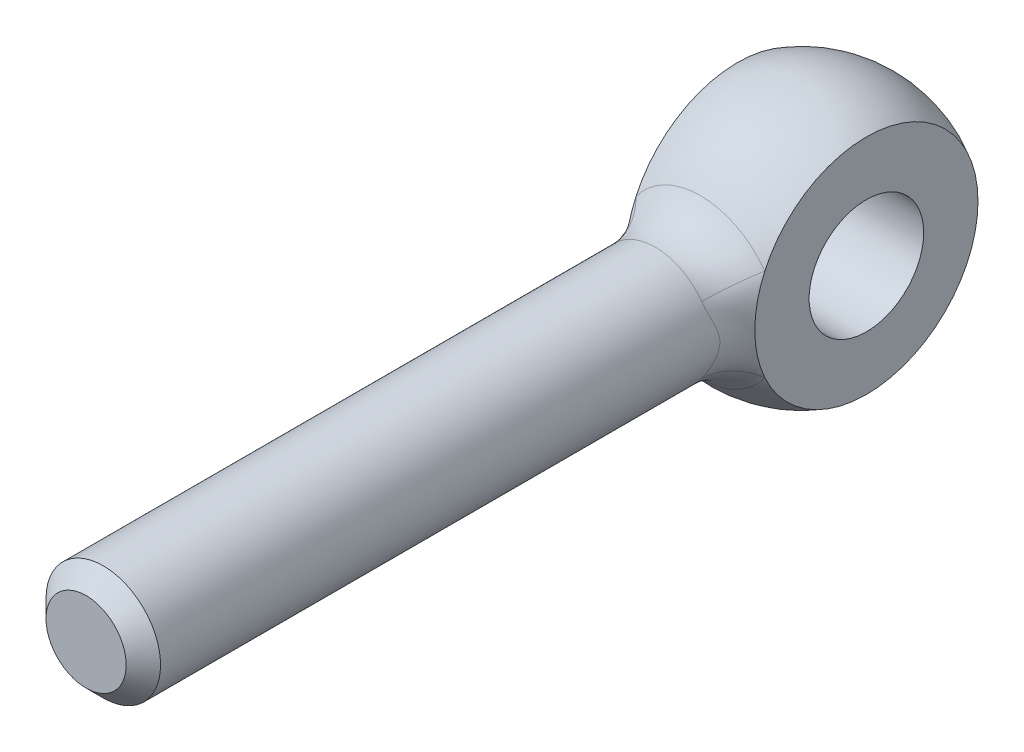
ISO-10303-21;
HEADER;
FILE_DESCRIPTION(('STEP AP214'),'2;1');
FILE_NAME('part.step','',(''),(''),'','','');
FILE_SCHEMA(('AUTOMOTIVE_DESIGN { 1 0 10303 214 1 1 1 1 }'));
ENDSEC;
DATA;
#1=APPLICATION_CONTEXT('core data for automotive mechanical design processes');
#2=APPLICATION_PROTOCOL_DEFINITION('international standard','automotive_design',2000,#1);
#3=PRODUCT_CONTEXT('',#1,'mechanical');
#4=PRODUCT('Part','Part','',(#3));
#5=PRODUCT_RELATED_PRODUCT_CATEGORY('part','',(#4));
#6=PRODUCT_DEFINITION_FORMATION('','',#4);
#7=PRODUCT_DEFINITION_CONTEXT('part definition',#1,'design');
#8=PRODUCT_DEFINITION('design','',#6,#7);
#9=PRODUCT_DEFINITION_SHAPE('','',#8);
#10=(LENGTH_UNIT() NAMED_UNIT(*) SI_UNIT(.MILLI.,.METRE.));
#11=(NAMED_UNIT(*) PLANE_ANGLE_UNIT() SI_UNIT($,.RADIAN.));
#12=(NAMED_UNIT(*) SI_UNIT($,.STERADIAN.) SOLID_ANGLE_UNIT());
#13=UNCERTAINTY_MEASURE_WITH_UNIT(LENGTH_MEASURE(1.E-05),#10,'distance_accuracy_value','');
#14=(GEOMETRIC_REPRESENTATION_CONTEXT(3) GLOBAL_UNCERTAINTY_ASSIGNED_CONTEXT((#13)) GLOBAL_UNIT_ASSIGNED_CONTEXT((#10,
#11,#12)) REPRESENTATION_CONTEXT('',''));
#15=CARTESIAN_POINT('',(0.,0.,0.));
#16=DIRECTION('',(0.,0.,1.));
#17=DIRECTION('',(1.,0.,0.));
#18=AXIS2_PLACEMENT_3D('',#15,#16,#17);
#19=CARTESIAN_POINT('',(0.,0.,0.));
#20=DIRECTION('',(1.,0.,0.));
#21=DIRECTION('',(0.,0.,-1.));
#22=AXIS2_PLACEMENT_3D('',#19,#20,#21);
#23=SPHERICAL_SURFACE('',#22,9.);
#24=CARTESIAN_POINT('',(-4.5,0.,0.));
#25=DIRECTION('',(-1.,0.,0.));
#26=DIRECTION('',(0.,0.,1.));
#27=AXIS2_PLACEMENT_3D('',#24,#25,#26);
#28=CIRCLE('',#27,7.79422863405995);
#29=CARTESIAN_POINT('',(-4.5,-3.22870813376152,7.09404283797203));
#30=VERTEX_POINT('',#29);
#31=CARTESIAN_POINT('',(-4.5,3.22870813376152,7.09404283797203));
#32=VERTEX_POINT('',#31);
#33=EDGE_CURVE('E65',#30,#32,#28,.F.);
#34=ORIENTED_EDGE('',*,*,#33,.T.);
#35=CARTESIAN_POINT('',(0.,0.,7.09404283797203));
#36=DIRECTION('',(0.,0.,-1.));
#37=DIRECTION('',(-1.,0.,0.));
#38=AXIS2_PLACEMENT_3D('',#35,#36,#37);
#39=CIRCLE('',#38,5.53846153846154);
#40=CARTESIAN_POINT('',(4.5,3.22870813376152,7.09404283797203));
#41=VERTEX_POINT('',#40);
#42=EDGE_CURVE('E73',#32,#41,#39,.T.);
#43=ORIENTED_EDGE('',*,*,#42,.T.);
#44=CARTESIAN_POINT('',(4.5,0.,0.));
#45=DIRECTION('',(-1.,0.,0.));
#46=DIRECTION('',(0.,0.,1.));
#47=AXIS2_PLACEMENT_3D('',#44,#45,#46);
#48=CIRCLE('',#47,7.79422863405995);
#49=CARTESIAN_POINT('',(4.5,-3.22870813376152,7.09404283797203));
#50=VERTEX_POINT('',#49);
#51=EDGE_CURVE('E61',#50,#41,#48,.F.);
#52=ORIENTED_EDGE('',*,*,#51,.F.);
#53=CARTESIAN_POINT('',(0.,0.,7.09404283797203));
#54=DIRECTION('',(0.,0.,-1.));
#55=DIRECTION('',(-1.,0.,0.));
#56=AXIS2_PLACEMENT_3D('',#53,#54,#55);
#57=CIRCLE('',#56,5.53846153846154);
#58=EDGE_CURVE('E70',#50,#30,#57,.T.);
#59=ORIENTED_EDGE('',*,*,#58,.T.);
#60=EDGE_LOOP('',(#34,#43,#52,#59));
#61=FACE_BOUND('',#60,.T.);
#62=ADVANCED_FACE('F14',(#61),#23,.T.);
#63=CARTESIAN_POINT('',(0.,0.,-10.));
#64=DIRECTION('',(0.,0.,-1.));
#65=DIRECTION('',(-1.,0.,0.));
#66=AXIS2_PLACEMENT_3D('',#63,#64,#65);
#67=CYLINDRICAL_SURFACE('',#66,4.);
#68=CARTESIAN_POINT('',(-4.5,-3.85444578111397,6.77445552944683));
#69=CARTESIAN_POINT('',(-3.04270473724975,-2.62315351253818,7.93032270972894));
#70=CARTESIAN_POINT('',(-2.7741231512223,-2.881707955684,10.1296027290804));
#71=CARTESIAN_POINT('',(-4.5,-3.80635520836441,6.80181404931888));
#72=CARTESIAN_POINT('',(-3.05482576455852,-2.6036944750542,7.96461619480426));
#73=CARTESIAN_POINT('',(-2.81753121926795,-2.83992613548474,10.1500330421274));
#74=CARTESIAN_POINT('',(-4.5,-3.75734620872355,6.8290243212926));
#75=CARTESIAN_POINT('',(-3.06839168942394,-2.58331636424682,7.99813663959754));
#76=CARTESIAN_POINT('',(-2.86015231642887,-2.79700081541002,10.1676065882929));
#77=CARTESIAN_POINT('',(-4.5,-3.65731222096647,6.88311775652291));
#78=CARTESIAN_POINT('',(-3.09821295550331,-2.54027572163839,8.06327876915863));
#79=CARTESIAN_POINT('',(-2.94360667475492,-2.70903056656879,10.197319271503));
#80=CARTESIAN_POINT('',(-4.5,-3.60628811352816,6.9100010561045));
#81=CARTESIAN_POINT('',(-3.11445034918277,-2.51763114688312,8.09489992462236));
#82=CARTESIAN_POINT('',(-2.98444070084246,-2.66398656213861,10.2094607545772));
#83=CARTESIAN_POINT('',(-4.5,-3.45034294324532,6.98990310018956));
#84=CARTESIAN_POINT('',(-3.16665597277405,-2.44590984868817,8.1861654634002));
#85=CARTESIAN_POINT('',(-3.10362883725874,-2.52629694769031,10.2380896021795));
#86=CARTESIAN_POINT('',(-4.5,-3.34210856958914,7.04242695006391));
#87=CARTESIAN_POINT('',(-3.20638316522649,-2.39264902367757,8.2429806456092));
#88=CARTESIAN_POINT('',(-3.17907335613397,-2.43070509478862,10.2469645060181));
#89=CARTESIAN_POINT('',(-4.5,-3.07131788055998,7.1656813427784));
#90=CARTESIAN_POINT('',(-3.30980222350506,-2.24847718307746,8.36667989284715));
#91=CARTESIAN_POINT('',(-3.3484402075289,-2.19463495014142,10.2469316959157));
#92=CARTESIAN_POINT('',(-4.5,-2.90397618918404,7.23557083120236));
#93=CARTESIAN_POINT('',(-3.37687085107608,-2.15099293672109,8.42942404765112));
#94=CARTESIAN_POINT('',(-3.4381775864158,-2.05112903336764,10.2297903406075));
#95=CARTESIAN_POINT('',(-4.5,-2.6352089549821,7.33585873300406));
#96=CARTESIAN_POINT('',(-3.48042901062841,-1.97974794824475,8.50775356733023));
#97=CARTESIAN_POINT('',(-3.55838650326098,-1.82895031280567,10.1852430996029));
#98=CARTESIAN_POINT('',(-4.5,-2.54243406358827,7.36859815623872));
#99=CARTESIAN_POINT('',(-3.51533532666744,-1.91871301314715,8.53118988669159));
#100=CARTESIAN_POINT('',(-3.5961245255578,-1.75356165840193,10.1671934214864));
#101=CARTESIAN_POINT('',(-4.5,-2.35049327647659,7.4320525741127));
#102=CARTESIAN_POINT('',(-3.58449538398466,-1.7884352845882,8.57274310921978));
#103=CARTESIAN_POINT('',(-3.66666176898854,-1.60082878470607,10.1262456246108));
#104=CARTESIAN_POINT('',(-4.5,-2.25132856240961,7.46276794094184));
#105=CARTESIAN_POINT('',(-3.61876374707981,-1.71923098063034,8.59090327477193));
#106=CARTESIAN_POINT('',(-3.69946189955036,-1.52348492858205,10.1033484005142));
#107=CARTESIAN_POINT('',(-4.5,-2.03046131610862,7.52611271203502));
#108=CARTESIAN_POINT('',(-3.69027444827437,-1.56151844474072,8.6245207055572));
#109=CARTESIAN_POINT('',(-3.76469519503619,-1.35514764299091,10.0506349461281));
#110=CARTESIAN_POINT('',(-4.5,-1.90763213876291,7.5583156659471));
#111=CARTESIAN_POINT('',(-3.72725176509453,-1.47161056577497,8.63921494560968));
#112=CARTESIAN_POINT('',(-3.79630400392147,-1.26387674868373,10.020296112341));
#113=CARTESIAN_POINT('',(-4.5,-1.6523218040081,7.61820329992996));
#114=CARTESIAN_POINT('',(-3.79632113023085,-1.28138713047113,8.66269061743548));
#115=CARTESIAN_POINT('',(-3.85283376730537,-1.07934568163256,9.95859137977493));
#116=CARTESIAN_POINT('',(-4.5,-1.51983775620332,7.64588661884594));
#117=CARTESIAN_POINT('',(-3.82847639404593,-1.18104454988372,8.67151974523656));
#118=CARTESIAN_POINT('',(-3.87775270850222,-0.986084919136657,9.92722517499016));
#119=CARTESIAN_POINT('',(-4.5,-1.24584793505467,7.69526663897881));
#120=CARTESIAN_POINT('',(-3.8857422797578,-0.971416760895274,8.68456342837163));
#121=CARTESIAN_POINT('',(-3.92072690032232,-0.798212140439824,9.86763071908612));
#122=CARTESIAN_POINT('',(-4.5,-1.10438777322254,7.71699102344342));
#123=CARTESIAN_POINT('',(-3.91095703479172,-0.862096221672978,8.6888316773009));
#124=CARTESIAN_POINT('',(-3.93881404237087,-0.703608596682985,9.83938833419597));
#125=CARTESIAN_POINT('',(-4.5,-0.81298603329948,7.75309875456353));
#126=CARTESIAN_POINT('',(-3.95269307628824,-0.635873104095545,8.69452000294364));
#127=CARTESIAN_POINT('',(-3.96815692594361,-0.512865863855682,9.79055451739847));
#128=CARTESIAN_POINT('',(-4.5,-0.663048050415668,7.7674851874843));
#129=CARTESIAN_POINT('',(-3.9692841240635,-0.518825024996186,8.69595666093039));
#130=CARTESIAN_POINT('',(-3.97941553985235,-0.416727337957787,9.76995986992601));
#131=CARTESIAN_POINT('',(-4.5,-0.365918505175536,7.78697722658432));
#132=CARTESIAN_POINT('',(-3.99168629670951,-0.286607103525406,8.69758027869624));
#133=CARTESIAN_POINT('',(-3.99451236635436,-0.228642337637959,9.74161988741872));
#134=CARTESIAN_POINT('',(-4.5,-0.219018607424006,7.79254362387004));
#135=CARTESIAN_POINT('',(-3.99806921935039,-0.171508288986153,8.69783425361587));
#136=CARTESIAN_POINT('',(-3.99871971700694,-0.136751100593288,9.73323857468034));
#137=CARTESIAN_POINT('',(-4.5,0.0755179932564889,7.79525312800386));
#138=CARTESIAN_POINT('',(-4.0011736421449,0.0591123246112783,8.69798034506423));
#139=CARTESIAN_POINT('',(-4.00077867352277,0.0471659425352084,9.72918999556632));
#140=CARTESIAN_POINT('',(-4.5,0.223154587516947,7.79239744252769));
#141=CARTESIAN_POINT('',(-3.99790203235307,0.174838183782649,8.6978727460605));
#142=CARTESIAN_POINT('',(-3.99863119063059,0.139191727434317,9.73352090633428));
#143=CARTESIAN_POINT('',(-4.5,0.5153988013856,7.77855435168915));
#144=CARTESIAN_POINT('',(-3.98201549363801,0.403449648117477,8.69691703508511));
#145=CARTESIAN_POINT('',(-3.98800822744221,0.32296739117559,9.75391826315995));
#146=CARTESIAN_POINT('',(-4.5,0.65998856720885,7.76752813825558));
#147=CARTESIAN_POINT('',(-3.96932852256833,0.516511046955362,8.69606347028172));
#148=CARTESIAN_POINT('',(-3.97950254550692,0.414713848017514,9.77004071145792));
#149=CARTESIAN_POINT('',(-4.5,0.94228575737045,7.73836483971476));
#150=CARTESIAN_POINT('',(-3.93569076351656,0.736344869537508,8.6923726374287));
#151=CARTESIAN_POINT('',(-3.95627218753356,0.596957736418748,9.81071532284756));
#152=CARTESIAN_POINT('',(-4.5,1.07998946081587,7.72022395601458));
#153=CARTESIAN_POINT('',(-3.91468418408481,0.843262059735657,8.6895253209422));
#154=CARTESIAN_POINT('',(-3.94154418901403,0.687454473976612,9.83527198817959));
#155=CARTESIAN_POINT('',(-4.5,1.37588488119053,7.67359135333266));
#156=CARTESIAN_POINT('',(-3.86060975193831,1.07137605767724,8.67936366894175));
#157=CARTESIAN_POINT('',(-3.90215083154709,0.886344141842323,9.8945073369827));
#158=CARTESIAN_POINT('',(-4.5,1.53205621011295,7.64370888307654));
#159=CARTESIAN_POINT('',(-3.82584552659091,1.19066873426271,8.67118584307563));
#160=CARTESIAN_POINT('',(-3.87602422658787,0.994368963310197,9.93022639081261));
#161=CARTESIAN_POINT('',(-4.5,1.83152716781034,7.57753636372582));
#162=CARTESIAN_POINT('',(-3.74933129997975,1.41560294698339,8.64748821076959));
#163=CARTESIAN_POINT('',(-3.81488436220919,1.20788558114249,10.0015265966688));
#164=CARTESIAN_POINT('',(-4.5,1.97482610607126,7.54124597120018));
#165=CARTESIAN_POINT('',(-3.70747741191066,1.5213009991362,8.63189853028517));
#166=CARTESIAN_POINT('',(-3.77987062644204,1.31337724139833,10.0371077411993));
#167=CARTESIAN_POINT('',(-4.5,2.24871161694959,7.46414404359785));
#168=CARTESIAN_POINT('',(-3.62012648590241,1.7179734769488,8.59208691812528));
#169=CARTESIAN_POINT('',(-3.70118920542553,1.5210087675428,10.1029124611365));
#170=CARTESIAN_POINT('',(-4.5,2.37934961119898,7.42335237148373));
#171=CARTESIAN_POINT('',(-3.574572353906,1.80898132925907,8.56781003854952));
#172=CARTESIAN_POINT('',(-3.65755891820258,1.62316096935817,10.1331581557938));
#173=CARTESIAN_POINT('',(-4.5,2.62960061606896,7.33843673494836));
#174=CARTESIAN_POINT('',(-3.48292493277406,1.97675657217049,8.51005890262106));
#175=CARTESIAN_POINT('',(-3.5616888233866,1.82393375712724,10.1845863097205));
#176=CARTESIAN_POINT('',(-4.5,2.7492173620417,7.29431390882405));
#177=CARTESIAN_POINT('',(-3.43680579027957,2.05343576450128,8.47648952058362));
#178=CARTESIAN_POINT('',(-3.50945194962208,1.92255553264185,10.2057718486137));
#179=CARTESIAN_POINT('',(-4.5,2.94999939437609,7.2149891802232));
#180=CARTESIAN_POINT('',(-3.35849710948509,2.17571119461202,8.4098829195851));
#181=CARTESIAN_POINT('',(-3.41071958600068,2.09141957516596,10.2322288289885));
#182=CARTESIAN_POINT('',(-4.5,3.03332698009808,7.18029900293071));
#183=CARTESIAN_POINT('',(-3.32563979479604,2.22433900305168,8.37868925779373));
#184=CARTESIAN_POINT('',(-3.36602915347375,2.16261785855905,10.2401482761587));
#185=CARTESIAN_POINT('',(-4.5,3.19484965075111,7.1099009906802));
#186=CARTESIAN_POINT('',(-3.26272074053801,2.31453556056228,8.3114926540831));
#187=CARTESIAN_POINT('',(-3.27220326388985,2.3021184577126,10.2480230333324));
#188=CARTESIAN_POINT('',(-4.5,3.27304643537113,7.07419349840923));
#189=CARTESIAN_POINT('',(-3.23268360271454,2.35604813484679,8.27546257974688));
#190=CARTESIAN_POINT('',(-3.22306929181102,2.37042172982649,10.2479809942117));
#191=CARTESIAN_POINT('',(-4.5,3.42565196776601,7.00158146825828));
#192=CARTESIAN_POINT('',(-3.17620411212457,2.43330706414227,8.19857609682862));
#193=CARTESIAN_POINT('',(-3.12008076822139,2.50445754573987,10.2388956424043));
#194=CARTESIAN_POINT('',(-4.5,3.50000806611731,6.96466797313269));
#195=CARTESIAN_POINT('',(-3.14984664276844,2.46892157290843,8.157655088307));
#196=CARTESIAN_POINT('',(-3.06617923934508,2.5701524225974,10.2297508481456));
#197=CARTESIAN_POINT('',(-4.5,3.64453597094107,6.8901322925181));
#198=CARTESIAN_POINT('',(-3.10187955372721,2.53501235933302,8.07177995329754));
#199=CARTESIAN_POINT('',(-2.95455075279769,2.69775137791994,10.2014354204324));
#200=CARTESIAN_POINT('',(-4.5,3.71470335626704,6.85250941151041));
#201=CARTESIAN_POINT('',(-3.08031937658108,2.56543141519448,8.02681699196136));
#202=CARTESIAN_POINT('',(-2.89681988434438,2.75965145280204,10.1822543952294));
#203=CARTESIAN_POINT('',(-4.5,3.78298226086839,6.81461996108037));
#204=CARTESIAN_POINT('',(-3.06161168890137,2.59377871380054,7.9802897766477));
#205=CARTESIAN_POINT('',(-2.83743688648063,2.81938857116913,10.1576271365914));
#206=(BOUNDED_SURFACE() B_SPLINE_SURFACE(3,2,((#68,#69,#70),(#71,#72,#73),(#74,#75,#76),(#77,
#78,#79),(#80,#81,#82),(#83,#84,#85),(#86,#87,#88),(#89,#90,#91),(#92,#93,#94),(#95,#96,#97),
(#98,#99,#100),(#101,#102,#103),(#104,#105,#106),(#107,#108,#109),(#110,#111,#112),(#113,#114,
#115),(#116,#117,#118),(#119,#120,#121),(#122,#123,#124),(#125,#126,#127),(#128,#129,#130),
(#131,#132,#133),(#134,#135,#136),(#137,#138,#139),(#140,#141,#142),(#143,#144,#145),(#146,#147,
#148),(#149,#150,#151),(#152,#153,#154),(#155,#156,#157),(#158,#159,#160),(#161,#162,#163),
(#164,#165,#166),(#167,#168,#169),(#170,#171,#172),(#173,#174,#175),(#176,#177,#178),(#179,#180,
#181),(#182,#183,#184),(#185,#186,#187),(#188,#189,#190),(#191,#192,#193),(#194,#195,#196),
(#197,#198,#199),(#200,#201,#202),(#203,#204,#205)),.UNSPECIFIED.,.F.,.F.,
.F.) B_SPLINE_SURFACE_WITH_KNOTS((4,2,2,2,2,2,2,2,2,2,2,2,2,2,2,2,2,2,2,2,2,2,4),(3,3),(0.,
0.366533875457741,0.732909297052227,1.46227559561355,2.47457458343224,2.98299508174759,
3.49132182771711,4.07744171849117,4.66373780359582,5.24726215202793,5.8305408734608,
6.38220343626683,6.93378689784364,7.4880071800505,8.04252376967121,8.71711530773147,
9.39174301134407,10.0635045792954,10.7350376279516,11.2394940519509,11.7437825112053,
12.2537566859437,12.7642599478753),(0.,1.),
.UNSPECIFIED.) GEOMETRIC_REPRESENTATION_ITEM() RATIONAL_B_SPLINE_SURFACE(((1.,0.873374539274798,
1.),(1.,0.875240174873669,1.),(1.,0.877181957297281,1.),(1.,0.881198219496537,1.),(1.,
0.883272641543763,1.),(1.,0.889648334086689,1.),(1.,0.894119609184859,1.),(1.,0.905097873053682,
1.),(1.,0.911721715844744,1.),(1.,0.921524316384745,1.),(1.,0.924776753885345,1.),(1.,
0.931143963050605,1.),(1.,0.934258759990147,1.),(1.,0.940716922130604,1.),(1.,0.944022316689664,
1.),(1.,0.950179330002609,1.),(1.,0.953030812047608,1.),(1.,0.958111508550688,1.),(1.,
0.960343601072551,1.),(1.,0.964046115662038,1.),(1.,0.965516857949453,1.),(1.,0.967507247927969,
1.),(1.,0.968074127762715,1.),(1.,0.96835024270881,1.),(1.,0.968059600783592,1.),(1.,
0.966647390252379,1.),(1.,0.965521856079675,1.),(1.,0.962536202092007,1.),(1.,0.960675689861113,
1.),(1.,0.955882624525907,1.),(1.,0.952805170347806,1.),(1.,0.945996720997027,1.),(1.,
0.942265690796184,1.),(1.,0.934394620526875,1.),(1.,0.930256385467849,1.),(1.,0.921773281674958,
1.),(1.,0.91742848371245,1.),(1.,0.90981895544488,1.),(1.,0.906554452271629,1.),(1.,
0.90010633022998,1.),(1.,0.89692268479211,1.),(1.,0.890676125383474,1.),(1.,0.887614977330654,
1.),(1.,0.881712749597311,1.),(1.,0.878871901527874,1.),(1.,0.876174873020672,1.))) REPRESENTATION_ITEM('') SURFACE());
#207=CARTESIAN_POINT('',(-2.83743688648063,2.81938857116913,10.1576271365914));
#208=CARTESIAN_POINT('',(-2.89681988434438,2.75965145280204,10.1822543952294));
#209=CARTESIAN_POINT('',(-2.95455075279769,2.69775137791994,10.2014354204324));
#210=CARTESIAN_POINT('',(-3.06617923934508,2.5701524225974,10.2297508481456));
#211=CARTESIAN_POINT('',(-3.12008076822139,2.50445754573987,10.2388956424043));
#212=CARTESIAN_POINT('',(-3.22306929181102,2.37042172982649,10.2479809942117));
#213=CARTESIAN_POINT('',(-3.27220326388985,2.3021184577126,10.2480230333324));
#214=CARTESIAN_POINT('',(-3.36602915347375,2.16261785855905,10.2401482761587));
#215=CARTESIAN_POINT('',(-3.41071958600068,2.09141957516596,10.2322288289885));
#216=CARTESIAN_POINT('',(-3.50945194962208,1.92255553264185,10.2057718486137));
#217=CARTESIAN_POINT('',(-3.5616888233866,1.82393375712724,10.1845863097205));
#218=CARTESIAN_POINT('',(-3.65755891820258,1.62316096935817,10.1331581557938));
#219=CARTESIAN_POINT('',(-3.70118920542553,1.5210087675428,10.1029124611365));
#220=CARTESIAN_POINT('',(-3.77987062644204,1.31337724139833,10.0371077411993));
#221=CARTESIAN_POINT('',(-3.81488436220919,1.20788558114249,10.0015265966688));
#222=CARTESIAN_POINT('',(-3.87602422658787,0.994368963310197,9.93022639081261));
#223=CARTESIAN_POINT('',(-3.90215083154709,0.886344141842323,9.8945073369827));
#224=CARTESIAN_POINT('',(-3.94154418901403,0.687454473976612,9.83527198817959));
#225=CARTESIAN_POINT('',(-3.95627218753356,0.596957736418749,9.81071532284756));
#226=CARTESIAN_POINT('',(-3.97950254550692,0.414713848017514,9.77004071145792));
#227=CARTESIAN_POINT('',(-3.98800822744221,0.32296739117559,9.75391826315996));
#228=CARTESIAN_POINT('',(-3.99863119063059,0.139191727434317,9.73352090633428));
#229=CARTESIAN_POINT('',(-4.00077867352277,0.0471659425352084,9.72918999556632));
#230=CARTESIAN_POINT('',(-3.99871971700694,-0.136751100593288,9.73323857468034));
#231=CARTESIAN_POINT('',(-3.99451236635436,-0.228642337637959,9.74161988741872));
#232=CARTESIAN_POINT('',(-3.97941553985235,-0.416727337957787,9.76995986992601));
#233=CARTESIAN_POINT('',(-3.96815692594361,-0.512865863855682,9.79055451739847));
#234=CARTESIAN_POINT('',(-3.93881404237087,-0.703608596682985,9.83938833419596));
#235=CARTESIAN_POINT('',(-3.92072690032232,-0.798212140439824,9.86763071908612));
#236=CARTESIAN_POINT('',(-3.87775270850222,-0.986084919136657,9.92722517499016));
#237=CARTESIAN_POINT('',(-3.85283376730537,-1.07934568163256,9.95859137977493));
#238=CARTESIAN_POINT('',(-3.79630400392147,-1.26387674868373,10.020296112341));
#239=CARTESIAN_POINT('',(-3.76469519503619,-1.35514764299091,10.0506349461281));
#240=CARTESIAN_POINT('',(-3.69946189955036,-1.52348492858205,10.1033484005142));
#241=CARTESIAN_POINT('',(-3.66666176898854,-1.60082878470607,10.1262456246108));
#242=CARTESIAN_POINT('',(-3.5961245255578,-1.75356165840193,10.1671934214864));
#243=CARTESIAN_POINT('',(-3.55838650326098,-1.82895031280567,10.1852430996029));
#244=CARTESIAN_POINT('',(-3.4381775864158,-2.05112903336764,10.2297903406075));
#245=CARTESIAN_POINT('',(-3.34844020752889,-2.19463495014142,10.2469316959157));
#246=CARTESIAN_POINT('',(-3.17907335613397,-2.43070509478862,10.2469645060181));
#247=CARTESIAN_POINT('',(-3.10362883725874,-2.52629694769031,10.2380896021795));
#248=CARTESIAN_POINT('',(-2.98444070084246,-2.66398656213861,10.2094607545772));
#249=CARTESIAN_POINT('',(-2.94360667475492,-2.70903056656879,10.197319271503));
#250=CARTESIAN_POINT('',(-2.86015231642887,-2.79700081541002,10.1676065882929));
#251=CARTESIAN_POINT('',(-2.81753121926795,-2.83992613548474,10.1500330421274));
#252=CARTESIAN_POINT('',(-2.7741231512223,-2.881707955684,10.1296027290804));
#253=B_SPLINE_CURVE_WITH_KNOTS('',3,(#207,#208,#209,#210,#211,#212,#213,#214,#215,#216,#217,
#218,#219,#220,#221,#222,#223,#224,#225,#226,#227,#228,#229,#230,#231,#232,#233,#234,#235,#236,
#237,#238,#239,#240,#241,#242,#243,#244,#245,#246,#247,#248,#249,#250,#251,#252),.UNSPECIFIED.,
.F.,.F.,(4,2,2,2,2,2,2,2,2,2,2,2,2,2,2,2,2,2,2,2,2,2,4),(0.,0.510503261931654,1.02047743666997,
1.52476589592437,2.02922231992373,2.70075536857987,3.37251693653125,4.04714464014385,
4.72173617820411,5.27625276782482,5.83047305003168,6.38205651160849,6.93371907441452,
7.51699779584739,8.1005221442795,8.68681822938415,9.27293812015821,9.78126486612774,
10.2896853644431,11.3019843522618,12.0313506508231,12.3977260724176,12.7642599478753),.UNSPECIFIED.);
#254=CARTESIAN_POINT('',(-3.25,2.33184476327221,10.2469507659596));
#255=VERTEX_POINT('',#254);
#256=CARTESIAN_POINT('',(-3.25,-2.3318447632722,10.2469507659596));
#257=VERTEX_POINT('',#256);
#258=EDGE_CURVE('E88',#255,#257,#253,.T.);
#259=ORIENTED_EDGE('',*,*,#258,.T.);
#260=CARTESIAN_POINT('',(0.,0.,10.2469507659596));
#261=DIRECTION('',(0.,0.,-1.));
#262=DIRECTION('',(-1.,0.,0.));
#263=AXIS2_PLACEMENT_3D('',#260,#261,#262);
#264=CIRCLE('',#263,4.);
#265=CARTESIAN_POINT('',(3.25,-2.33184476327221,10.2469507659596));
#266=VERTEX_POINT('',#265);
#267=EDGE_CURVE('E9',#257,#266,#264,.F.);
#268=ORIENTED_EDGE('',*,*,#267,.T.);
#269=CARTESIAN_POINT('',(4.5,3.85444584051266,6.7744554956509));
#270=CARTESIAN_POINT('',(3.04270471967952,2.62315352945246,7.93032267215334));
#271=CARTESIAN_POINT('',(2.77412315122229,2.88170795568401,10.1296027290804));
#272=CARTESIAN_POINT('',(4.5,3.80635523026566,6.80181403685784));
#273=CARTESIAN_POINT('',(3.05482575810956,2.60369448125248,7.96461618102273));
#274=CARTESIAN_POINT('',(2.81753121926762,2.83992613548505,10.1500330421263));
#275=CARTESIAN_POINT('',(4.5,3.75734621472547,6.82902431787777));
#276=CARTESIAN_POINT('',(3.06839168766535,2.58331636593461,7.99813663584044));
#277=CARTESIAN_POINT('',(2.86015231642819,2.7970008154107,10.1676065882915));
#278=CARTESIAN_POINT('',(4.5,3.6573122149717,6.8831177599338));
#279=CARTESIAN_POINT('',(3.09821295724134,2.54027571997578,8.06327877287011));
#280=CARTESIAN_POINT('',(2.94360667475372,2.70903056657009,10.1973192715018));
#281=CARTESIAN_POINT('',(4.5,3.60628811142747,6.91000105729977));
#282=CARTESIAN_POINT('',(3.11445034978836,2.51763114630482,8.09489992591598));
#283=CARTESIAN_POINT('',(2.98444070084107,2.66398656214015,10.2094607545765));
#284=CARTESIAN_POINT('',(4.5,3.45034294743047,6.98990309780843));
#285=CARTESIAN_POINT('',(3.16665597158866,2.44590984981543,8.18616546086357));
#286=CARTESIAN_POINT('',(3.10362883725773,2.52629694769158,10.2380896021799));
#287=CARTESIAN_POINT('',(4.5,3.34210857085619,7.04242694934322));
#288=CARTESIAN_POINT('',(3.20638316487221,2.39264902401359,8.24298064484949));
#289=CARTESIAN_POINT('',(3.1790733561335,2.43070509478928,10.2469645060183));
#290=CARTESIAN_POINT('',(4.5,3.07131787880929,7.16568134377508));
#291=CARTESIAN_POINT('',(3.3098022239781,2.24847718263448,8.36667989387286));
#292=CARTESIAN_POINT('',(3.3484402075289,2.19463495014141,10.2469316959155));
#293=CARTESIAN_POINT('',(4.5,2.90397618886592,7.2355708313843));
#294=CARTESIAN_POINT('',(3.37687085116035,2.15099293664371,8.42942404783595));
#295=CARTESIAN_POINT('',(3.4381775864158,2.05112903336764,10.2297903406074));
#296=CARTESIAN_POINT('',(4.5,2.63520895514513,7.33585873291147));
#297=CARTESIAN_POINT('',(3.48042901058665,1.97974794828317,8.50775356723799));
#298=CARTESIAN_POINT('',(3.55838650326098,1.82895031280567,10.1852430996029));
#299=CARTESIAN_POINT('',(4.5,2.54243406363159,7.36859815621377));
#300=CARTESIAN_POINT('',(3.5153353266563,1.91871301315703,8.53118988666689));
#301=CARTESIAN_POINT('',(3.5961245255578,1.75356165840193,10.1671934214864));
#302=CARTESIAN_POINT('',(4.5,2.3504932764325,7.4320525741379));
#303=CARTESIAN_POINT('',(3.58449538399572,1.78843528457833,8.57274310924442));
#304=CARTESIAN_POINT('',(3.66666176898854,1.60082878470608,10.1262456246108));
#305=CARTESIAN_POINT('',(4.5,2.25132856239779,7.46276794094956));
#306=CARTESIAN_POINT('',(3.61876374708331,1.71923098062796,8.59090327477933));
#307=CARTESIAN_POINT('',(3.69946189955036,1.52348492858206,10.1033484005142));
#308=CARTESIAN_POINT('',(4.5,2.03046131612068,7.52611271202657));
#309=CARTESIAN_POINT('',(3.69027444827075,1.56151844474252,8.6245207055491));
#310=CARTESIAN_POINT('',(3.76469519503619,1.35514764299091,10.0506349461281));
#311=CARTESIAN_POINT('',(4.5,1.90763213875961,7.55831566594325));
#312=CARTESIAN_POINT('',(3.72725176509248,1.47161056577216,8.63921494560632));
#313=CARTESIAN_POINT('',(3.79630400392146,1.26387674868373,10.020296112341));
#314=CARTESIAN_POINT('',(4.5,1.6523218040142,7.61820329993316));
#315=CARTESIAN_POINT('',(3.79632113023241,1.28138713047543,8.66269061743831));
#316=CARTESIAN_POINT('',(3.85283376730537,1.07934568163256,9.95859137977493));
#317=CARTESIAN_POINT('',(4.5,1.51983775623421,7.64588661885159));
#318=CARTESIAN_POINT('',(3.82847639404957,1.18104454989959,8.6715197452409));
#319=CARTESIAN_POINT('',(3.87775270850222,0.986084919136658,9.92722517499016));
#320=CARTESIAN_POINT('',(4.5,1.24584793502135,7.69526663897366));
#321=CARTESIAN_POINT('',(3.88574227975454,0.971416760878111,8.68456342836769));
#322=CARTESIAN_POINT('',(3.92072690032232,0.798212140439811,9.86763071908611));
#323=CARTESIAN_POINT('',(4.5,1.10438777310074,7.7169910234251));
#324=CARTESIAN_POINT('',(3.91095703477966,0.862096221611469,8.6888316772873));
#325=CARTESIAN_POINT('',(3.93881404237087,0.703608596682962,9.83938833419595));
#326=CARTESIAN_POINT('',(4.5,0.812986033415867,7.75309875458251));
#327=CARTESIAN_POINT('',(3.95269307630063,0.635873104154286,8.69452000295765));
#328=CARTESIAN_POINT('',(3.96815692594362,0.512865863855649,9.79055451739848));
#329=CARTESIAN_POINT('',(4.5,0.663048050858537,7.76748518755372));
#330=CARTESIAN_POINT('',(3.96928412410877,0.518825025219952,8.69595666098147));
#331=CARTESIAN_POINT('',(3.97941553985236,0.416727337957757,9.76995986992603));
#332=CARTESIAN_POINT('',(4.5,0.365918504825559,7.78697722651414));
#333=CARTESIAN_POINT('',(3.99168629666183,0.286607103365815,8.69758027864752));
#334=CARTESIAN_POINT('',(3.99451236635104,0.228642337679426,9.74161988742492));
#335=CARTESIAN_POINT('',(4.5,0.2190186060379,7.79254362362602));
#336=CARTESIAN_POINT('',(3.99806921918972,0.171508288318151,8.69783425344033));
#337=CARTESIAN_POINT('',(3.99871971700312,0.136751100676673,9.7332385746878));
#338=CARTESIAN_POINT('',(4.5,-0.0755179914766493,7.79525312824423));
#339=CARTESIAN_POINT('',(4.00117364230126,-0.0591123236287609,8.69798034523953));
#340=CARTESIAN_POINT('',(4.00077867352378,-0.0471659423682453,9.72918999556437));
#341=CARTESIAN_POINT('',(4.5,-0.223154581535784,7.79239744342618));
#342=CARTESIAN_POINT('',(3.99790203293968,-0.17483818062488,8.69787274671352));
#343=CARTESIAN_POINT('',(3.99863119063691,-0.139191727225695,9.73352090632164));
#344=CARTESIAN_POINT('',(4.5,-0.515398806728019,7.77855435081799));
#345=CARTESIAN_POINT('',(3.9820154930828,-0.403449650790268,8.69691703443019));
#346=CARTESIAN_POINT('',(3.98800822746,-0.322967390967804,9.75391826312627));
#347=CARTESIAN_POINT('',(4.5,-0.659988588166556,7.76752813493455));
#348=CARTESIAN_POINT('',(3.96932852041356,-0.516511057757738,8.69606346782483));
#349=CARTESIAN_POINT('',(3.97950254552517,-0.41471384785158,9.77004071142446));
#350=CARTESIAN_POINT('',(4.5,-0.942285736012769,7.73836484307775));
#351=CARTESIAN_POINT('',(3.93569076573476,-0.736344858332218,8.69237263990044));
#352=CARTESIAN_POINT('',(3.95627218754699,-0.596957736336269,9.81071532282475));
#353=CARTESIAN_POINT('',(4.5,-1.07998938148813,7.72022396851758));
#354=CARTESIAN_POINT('',(3.91468419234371,-0.843262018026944,8.68952533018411));
#355=CARTESIAN_POINT('',(3.94154418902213,-0.687454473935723,9.83527198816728));
#356=CARTESIAN_POINT('',(4.5,-1.37588478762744,7.67359136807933));
#357=CARTESIAN_POINT('',(3.86060976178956,-1.07137600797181,8.67936367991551));
#358=CARTESIAN_POINT('',(3.90215083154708,-0.886344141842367,9.89450733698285));
#359=CARTESIAN_POINT('',(4.5,-1.53205618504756,7.64370888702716));
#360=CARTESIAN_POINT('',(3.82584552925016,-1.19066872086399,8.67118584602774));
#361=CARTESIAN_POINT('',(3.87602422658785,-0.99436896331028,9.93022639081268));
#362=CARTESIAN_POINT('',(4.5,-1.83152719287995,7.57753635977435));
#363=CARTESIAN_POINT('',(3.74933129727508,-1.41560296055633,8.64748820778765));
#364=CARTESIAN_POINT('',(3.81488436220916,-1.20788558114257,10.0015265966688));
#365=CARTESIAN_POINT('',(4.5,-1.9748261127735,7.54124597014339));
#366=CARTESIAN_POINT('',(3.7074774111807,-1.52130100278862,8.63189852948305));
#367=CARTESIAN_POINT('',(3.77987062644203,-1.31337724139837,10.0371077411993));
#368=CARTESIAN_POINT('',(4.5,-2.24871161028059,7.46414404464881));
#369=CARTESIAN_POINT('',(3.62012648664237,-1.71797347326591,8.59208691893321));
#370=CARTESIAN_POINT('',(3.70118920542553,-1.52100876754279,10.1029124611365));
#371=CARTESIAN_POINT('',(4.5,-2.37934960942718,7.42335237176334));
#372=CARTESIAN_POINT('',(3.57457235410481,-1.80898132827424,8.5678100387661));
#373=CARTESIAN_POINT('',(3.65755891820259,-1.62316096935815,10.1331581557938));
#374=CARTESIAN_POINT('',(4.5,-2.62960061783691,7.33843673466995));
#375=CARTESIAN_POINT('',(3.48292493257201,-1.97675657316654,8.51005890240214));
#376=CARTESIAN_POINT('',(3.56168882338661,-1.82393375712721,10.1845863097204));
#377=CARTESIAN_POINT('',(4.5,-2.74921736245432,7.29431390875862));
#378=CARTESIAN_POINT('',(3.43680579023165,-2.05343576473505,8.47648952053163));
#379=CARTESIAN_POINT('',(3.50945194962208,-1.92255553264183,10.2057718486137));
#380=CARTESIAN_POINT('',(4.5,-2.94999939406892,7.21498918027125));
#381=CARTESIAN_POINT('',(3.35849710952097,-2.17571119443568,8.40988291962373));
#382=CARTESIAN_POINT('',(3.41071958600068,-2.09141957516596,10.2322288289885));
#383=CARTESIAN_POINT('',(4.5,-3.03332698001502,7.18029900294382));
#384=CARTESIAN_POINT('',(3.32563979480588,-2.22433900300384,8.37868925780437));
#385=CARTESIAN_POINT('',(3.36602915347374,-2.16261785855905,10.2401482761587));
#386=CARTESIAN_POINT('',(4.5,-3.19484965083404,7.10990099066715));
#387=CARTESIAN_POINT('',(3.26272074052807,-2.31453556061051,8.31149265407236));
#388=CARTESIAN_POINT('',(3.27220326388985,-2.3021184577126,10.2480230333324));
#389=CARTESIAN_POINT('',(4.5,-3.27304643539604,7.07419349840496));
#390=CARTESIAN_POINT('',(3.23268360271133,-2.35604813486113,8.27546257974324));
#391=CARTESIAN_POINT('',(3.22306929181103,-2.37042172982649,10.2479809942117));
#392=CARTESIAN_POINT('',(4.5,-3.42565196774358,7.00158146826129));
#393=CARTESIAN_POINT('',(3.17620411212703,-2.43330706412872,8.19857609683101));
#394=CARTESIAN_POINT('',(3.1200807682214,-2.50445754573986,10.2388956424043));
#395=CARTESIAN_POINT('',(4.5,-3.50000806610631,6.96466797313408));
#396=CARTESIAN_POINT('',(3.1498466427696,-2.46892157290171,8.15765508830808));
#397=CARTESIAN_POINT('',(3.06617923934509,-2.57015242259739,10.2297508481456));
#398=CARTESIAN_POINT('',(4.5,-3.64453597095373,6.89013229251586));
#399=CARTESIAN_POINT('',(3.10187955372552,-2.53501235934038,8.07177995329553));
#400=CARTESIAN_POINT('',(2.9545507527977,-2.69775137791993,10.2014354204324));
#401=CARTESIAN_POINT('',(4.5,-3.71470335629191,6.85250941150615));
#402=CARTESIAN_POINT('',(3.08031937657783,-2.5654314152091,8.02681699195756));
#403=CARTESIAN_POINT('',(2.89681988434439,-2.75965145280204,10.1822543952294));
#404=CARTESIAN_POINT('',(4.5,-3.78298226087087,6.814619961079));
#405=CARTESIAN_POINT('',(3.06161168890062,-2.59377871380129,7.98028977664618));
#406=CARTESIAN_POINT('',(2.83743688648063,-2.81938857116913,10.1576271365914));
#407=(BOUNDED_SURFACE() B_SPLINE_SURFACE(3,2,((#269,#270,#271),(#272,#273,#274),(#275,#276,
#277),(#278,#279,#280),(#281,#282,#283),(#284,#285,#286),(#287,#288,#289),(#290,#291,#292),
(#293,#294,#295),(#296,#297,#298),(#299,#300,#301),(#302,#303,#304),(#305,#306,#307),(#308,#309,
#310),(#311,#312,#313),(#314,#315,#316),(#317,#318,#319),(#320,#321,#322),(#323,#324,#325),
(#326,#327,#328),(#329,#330,#331),(#332,#333,#334),(#335,#336,#337),(#338,#339,#340),(#341,#342,
#343),(#344,#345,#346),(#347,#348,#349),(#350,#351,#352),(#353,#354,#355),(#356,#357,#358),
(#359,#360,#361),(#362,#363,#364),(#365,#366,#367),(#368,#369,#370),(#371,#372,#373),(#374,#375,
#376),(#377,#378,#379),(#380,#381,#382),(#383,#384,#385),(#386,#387,#388),(#389,#390,#391),
(#392,#393,#394),(#395,#396,#397),(#398,#399,#400),(#401,#402,#403),(#404,#405,#406)),
.UNSPECIFIED.,.F.,.F.,.F.) B_SPLINE_SURFACE_WITH_KNOTS((4,2,2,2,2,2,2,2,2,2,2,2,2,2,2,2,2,2,2,2,
2,2,4),(3,3),(0.,0.366533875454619,0.732909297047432,1.4622755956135,2.47457458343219,
2.98299508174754,3.49132182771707,4.07744171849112,4.66373780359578,5.24726215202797,
5.83054087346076,6.38220343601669,6.93378689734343,7.48800717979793,8.04252376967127,
8.71711530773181,9.39174301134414,10.0635045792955,10.7350376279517,11.239494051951,
11.7437825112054,12.2537566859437,12.7642599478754),(0.,1.),
.UNSPECIFIED.) GEOMETRIC_REPRESENTATION_ITEM() RATIONAL_B_SPLINE_SURFACE(((1.,0.873374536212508,
1.),(1.,0.875240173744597,1.),(1.,0.877181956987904,1.),(1.,0.881198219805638,1.),(1.,
0.883272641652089,1.),(1.,0.88964833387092,1.),(1.,0.894119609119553,1.),(1.,0.905097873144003,
1.),(1.,0.911721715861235,1.),(1.,0.921524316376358,1.),(1.,0.924776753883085,1.),(1.,
0.931143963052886,1.),(1.,0.934258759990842,1.),(1.,0.940716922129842,1.),(1.,0.944022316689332,
1.),(1.,0.950179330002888,1.),(1.,0.953030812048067,1.),(1.,0.958111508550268,1.),(1.,
0.960343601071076,1.),(1.,0.964046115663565,1.),(1.,0.965516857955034,1.),(1.,0.967507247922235,
1.),(1.,0.968074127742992,1.),(1.,0.968350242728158,1.),(1.,0.968059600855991,1.),(1.,
0.966647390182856,1.),(1.,0.965521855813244,1.),(1.,0.962536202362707,1.),(1.,0.960675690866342,
1.),(1.,0.955882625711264,1.),(1.,0.952805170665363,1.),(1.,0.9459967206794,1.),(1.,
0.942265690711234,1.),(1.,0.934394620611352,1.),(1.,0.930256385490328,1.),(1.,0.92177328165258,
1.),(1.,0.917428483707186,1.),(1.,0.909818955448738,1.),(1.,0.906554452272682,1.),(1.,
0.900106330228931,1.),(1.,0.896922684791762,1.),(1.,0.890676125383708,1.),(1.,0.887614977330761,
1.),(1.,0.881712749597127,1.),(1.,0.878871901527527,1.),(1.,0.876174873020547,1.))) REPRESENTATION_ITEM('') SURFACE());
#408=CARTESIAN_POINT('',(2.83743688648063,-2.81938857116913,10.1576271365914));
#409=CARTESIAN_POINT('',(2.89681988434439,-2.75965145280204,10.1822543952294));
#410=CARTESIAN_POINT('',(2.9545507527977,-2.69775137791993,10.2014354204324));
#411=CARTESIAN_POINT('',(3.06617923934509,-2.57015242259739,10.2297508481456));
#412=CARTESIAN_POINT('',(3.1200807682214,-2.50445754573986,10.2388956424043));
#413=CARTESIAN_POINT('',(3.22306929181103,-2.37042172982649,10.2479809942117));
#414=CARTESIAN_POINT('',(3.27220326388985,-2.3021184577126,10.2480230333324));
#415=CARTESIAN_POINT('',(3.36602915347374,-2.16261785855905,10.2401482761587));
#416=CARTESIAN_POINT('',(3.41071958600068,-2.09141957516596,10.2322288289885));
#417=CARTESIAN_POINT('',(3.50945194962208,-1.92255553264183,10.2057718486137));
#418=CARTESIAN_POINT('',(3.56168882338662,-1.82393375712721,10.1845863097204));
#419=CARTESIAN_POINT('',(3.65755891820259,-1.62316096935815,10.1331581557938));
#420=CARTESIAN_POINT('',(3.70118920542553,-1.52100876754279,10.1029124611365));
#421=CARTESIAN_POINT('',(3.77987062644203,-1.31337724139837,10.0371077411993));
#422=CARTESIAN_POINT('',(3.81488436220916,-1.20788558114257,10.0015265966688));
#423=CARTESIAN_POINT('',(3.87602422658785,-0.99436896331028,9.93022639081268));
#424=CARTESIAN_POINT('',(3.90215083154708,-0.886344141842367,9.89450733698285));
#425=CARTESIAN_POINT('',(3.94154418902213,-0.687454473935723,9.83527198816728));
#426=CARTESIAN_POINT('',(3.95627218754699,-0.596957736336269,9.81071532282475));
#427=CARTESIAN_POINT('',(3.97950254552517,-0.41471384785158,9.77004071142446));
#428=CARTESIAN_POINT('',(3.98800822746,-0.322967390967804,9.75391826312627));
#429=CARTESIAN_POINT('',(3.99863119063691,-0.139191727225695,9.73352090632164));
#430=CARTESIAN_POINT('',(4.00077867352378,-0.0471659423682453,9.72918999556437));
#431=CARTESIAN_POINT('',(3.99871971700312,0.136751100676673,9.73323857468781));
#432=CARTESIAN_POINT('',(3.99451236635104,0.228642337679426,9.74161988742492));
#433=CARTESIAN_POINT('',(3.97941553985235,0.416727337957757,9.76995986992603));
#434=CARTESIAN_POINT('',(3.96815692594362,0.51286586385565,9.79055451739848));
#435=CARTESIAN_POINT('',(3.93881404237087,0.703608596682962,9.83938833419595));
#436=CARTESIAN_POINT('',(3.92072690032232,0.798212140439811,9.86763071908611));
#437=CARTESIAN_POINT('',(3.87775270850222,0.986084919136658,9.92722517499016));
#438=CARTESIAN_POINT('',(3.85283376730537,1.07934568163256,9.95859137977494));
#439=CARTESIAN_POINT('',(3.79630400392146,1.26387674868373,10.020296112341));
#440=CARTESIAN_POINT('',(3.76469519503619,1.35514764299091,10.0506349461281));
#441=CARTESIAN_POINT('',(3.69946189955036,1.52348492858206,10.1033484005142));
#442=CARTESIAN_POINT('',(3.66666176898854,1.60082878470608,10.1262456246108));
#443=CARTESIAN_POINT('',(3.5961245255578,1.75356165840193,10.1671934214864));
#444=CARTESIAN_POINT('',(3.55838650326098,1.82895031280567,10.1852430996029));
#445=CARTESIAN_POINT('',(3.4381775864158,2.05112903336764,10.2297903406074));
#446=CARTESIAN_POINT('',(3.3484402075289,2.19463495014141,10.2469316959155));
#447=CARTESIAN_POINT('',(3.1790733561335,2.43070509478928,10.2469645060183));
#448=CARTESIAN_POINT('',(3.10362883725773,2.52629694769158,10.2380896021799));
#449=CARTESIAN_POINT('',(2.98444070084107,2.66398656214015,10.2094607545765));
#450=CARTESIAN_POINT('',(2.94360667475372,2.70903056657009,10.1973192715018));
#451=CARTESIAN_POINT('',(2.86015231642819,2.7970008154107,10.1676065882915));
#452=CARTESIAN_POINT('',(2.81753121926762,2.83992613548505,10.1500330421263));
#453=CARTESIAN_POINT('',(2.77412315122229,2.88170795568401,10.1296027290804));
#454=B_SPLINE_CURVE_WITH_KNOTS('',3,(#408,#409,#410,#411,#412,#413,#414,#415,#416,#417,#418,
#419,#420,#421,#422,#423,#424,#425,#426,#427,#428,#429,#430,#431,#432,#433,#434,#435,#436,#437,
#438,#439,#440,#441,#442,#443,#444,#445,#446,#447,#448,#449,#450,#451,#452,#453),.UNSPECIFIED.,
.F.,.F.,(4,2,2,2,2,2,2,2,2,2,2,2,2,2,2,2,2,2,2,2,2,2,4),(0.,0.510503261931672,1.02047743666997,
1.52476589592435,2.02922231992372,2.70075536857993,3.37251693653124,4.04714464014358,
4.72173617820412,5.27625276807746,5.83047305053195,6.38205651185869,6.93371907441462,
7.51699779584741,8.1005221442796,8.68681822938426,9.27293812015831,9.78126486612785,
10.2896853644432,11.3019843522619,12.0313506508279,12.3977260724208,12.7642599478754),.UNSPECIFIED.);
#455=CARTESIAN_POINT('',(3.25,2.33184476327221,10.2469507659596));
#456=VERTEX_POINT('',#455);
#457=EDGE_CURVE('E27',#266,#456,#454,.T.);
#458=ORIENTED_EDGE('',*,*,#457,.T.);
#459=CARTESIAN_POINT('',(0.,0.,10.2469507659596));
#460=DIRECTION('',(0.,0.,-1.));
#461=DIRECTION('',(-1.,0.,0.));
#462=AXIS2_PLACEMENT_3D('',#459,#460,#461);
#463=CIRCLE('',#462,4.);
#464=EDGE_CURVE('E101',#456,#255,#463,.F.);
#465=ORIENTED_EDGE('',*,*,#464,.T.);
#466=EDGE_LOOP('',(#259,#268,#458,#465));
#467=FACE_BOUND('',#466,.T.);
#468=CARTESIAN_POINT('',(0.,0.,48.8));
#469=DIRECTION('',(0.,0.,-1.));
#470=DIRECTION('',(-1.,0.,0.));
#471=AXIS2_PLACEMENT_3D('',#468,#469,#470);
#472=CIRCLE('',#471,4.);
#473=CARTESIAN_POINT('',(-4.,0.,48.8));
#474=VERTEX_POINT('',#473);
#475=EDGE_CURVE('E86',#474,#474,#472,.T.);
#476=ORIENTED_EDGE('',*,*,#475,.T.);
#477=EDGE_LOOP('',(#476));
#478=FACE_BOUND('',#477,.T.);
#479=ADVANCED_FACE('F107',(#467,#478),#67,.T.);
#480=CARTESIAN_POINT('',(0.,0.,50.));
#481=DIRECTION('',(0.,0.,-1.));
#482=DIRECTION('',(-1.,0.,0.));
#483=AXIS2_PLACEMENT_3D('',#480,#481,#482);
#484=CONICAL_SURFACE('',#483,2.8,0.785398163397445);
#485=ORIENTED_EDGE('',*,*,#475,.F.);
#486=EDGE_LOOP('',(#485));
#487=FACE_BOUND('',#486,.T.);
#488=CARTESIAN_POINT('',(0.,0.,50.));
#489=DIRECTION('',(0.,0.,-1.));
#490=DIRECTION('',(-1.,0.,0.));
#491=AXIS2_PLACEMENT_3D('',#488,#489,#490);
#492=CIRCLE('',#491,2.8);
#493=CARTESIAN_POINT('',(-2.8,0.,50.));
#494=VERTEX_POINT('',#493);
#495=EDGE_CURVE('E74',#494,#494,#492,.T.);
#496=ORIENTED_EDGE('',*,*,#495,.T.);
#497=EDGE_LOOP('',(#496));
#498=FACE_BOUND('',#497,.T.);
#499=ADVANCED_FACE('F111',(#487,#498),#484,.T.);
#500=CARTESIAN_POINT('',(0.,2.8,50.));
#501=DIRECTION('',(0.,0.,1.));
#502=DIRECTION('',(1.,0.,0.));
#503=AXIS2_PLACEMENT_3D('',#500,#501,#502);
#504=PLANE('',#503);
#505=ORIENTED_EDGE('',*,*,#495,.F.);
#506=EDGE_LOOP('',(#505));
#507=FACE_BOUND('',#506,.T.);
#508=ADVANCED_FACE('F159',(#507),#504,.T.);
#509=CARTESIAN_POINT('',(4.5,-15.,-10.));
#510=DIRECTION('',(-1.,0.,0.));
#511=DIRECTION('',(0.,0.,1.));
#512=AXIS2_PLACEMENT_3D('',#509,#510,#511);
#513=PLANE('',#512);
#514=ORIENTED_EDGE('',*,*,#51,.T.);
#515=EDGE_CURVE('E57',#41,#50,#48,.F.);
#516=ORIENTED_EDGE('',*,*,#515,.T.);
#517=EDGE_LOOP('',(#514,#516));
#518=FACE_BOUND('',#517,.T.);
#519=CARTESIAN_POINT('',(4.5,0.,0.));
#520=DIRECTION('',(1.,0.,0.));
#521=DIRECTION('',(0.,0.,-1.));
#522=AXIS2_PLACEMENT_3D('',#519,#520,#521);
#523=CIRCLE('',#522,4.);
#524=CARTESIAN_POINT('',(4.5,0.,-4.));
#525=VERTEX_POINT('',#524);
#526=EDGE_CURVE('E249',#525,#525,#523,.T.);
#527=ORIENTED_EDGE('',*,*,#526,.F.);
#528=EDGE_LOOP('',(#527));
#529=FACE_BOUND('',#528,.T.);
#530=ADVANCED_FACE('F59',(#518,#529),#513,.F.);
#531=CARTESIAN_POINT('',(-4.5,-15.,-10.));
#532=DIRECTION('',(-1.,0.,0.));
#533=DIRECTION('',(0.,0.,1.));
#534=AXIS2_PLACEMENT_3D('',#531,#532,#533);
#535=PLANE('',#534);
#536=ORIENTED_EDGE('',*,*,#33,.F.);
#537=EDGE_CURVE('E79',#32,#30,#28,.F.);
#538=ORIENTED_EDGE('',*,*,#537,.F.);
#539=EDGE_LOOP('',(#536,#538));
#540=FACE_BOUND('',#539,.T.);
#541=CARTESIAN_POINT('',(-4.5,0.,0.));
#542=DIRECTION('',(-1.,0.,0.));
#543=DIRECTION('',(0.,0.,1.));
#544=AXIS2_PLACEMENT_3D('',#541,#542,#543);
#545=CIRCLE('',#544,4.);
#546=CARTESIAN_POINT('',(-4.5,0.,4.));
#547=VERTEX_POINT('',#546);
#548=EDGE_CURVE('E138',#547,#547,#545,.F.);
#549=ORIENTED_EDGE('',*,*,#548,.T.);
#550=EDGE_LOOP('',(#549));
#551=FACE_BOUND('',#550,.T.);
#552=ADVANCED_FACE('F126',(#540,#551),#535,.T.);
#553=CARTESIAN_POINT('',(6.5,4.66368952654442,10.2469507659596));
#554=DIRECTION('',(-0.582961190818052,0.8125,0.));
#555=DIRECTION('',(0.8125,0.582961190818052,0.));
#556=AXIS2_PLACEMENT_3D('',#553,#554,#555);
#557=CIRCLE('',#556,4.);
#558=EDGE_CURVE('E80',#456,#41,#557,.F.);
#559=ORIENTED_EDGE('',*,*,#558,.F.);
#560=ORIENTED_EDGE('',*,*,#457,.F.);
#561=CARTESIAN_POINT('',(6.5,-4.66368952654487,10.2469507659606));
#562=DIRECTION('',(0.582961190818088,0.812499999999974,0.));
#563=DIRECTION('',(0.812499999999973,-0.582961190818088,0.));
#564=AXIS2_PLACEMENT_3D('',#561,#562,#563);
#565=CIRCLE('',#564,4.);
#566=EDGE_CURVE('E76',#50,#266,#565,.T.);
#567=ORIENTED_EDGE('',*,*,#566,.F.);
#568=ORIENTED_EDGE('',*,*,#515,.F.);
#569=EDGE_LOOP('',(#559,#560,#567,#568));
#570=FACE_BOUND('',#569,.T.);
#571=ADVANCED_FACE('F77',(#570),#407,.F.);
#572=CARTESIAN_POINT('',(0.,0.,10.2469507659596));
#573=DIRECTION('',(0.,0.,-1.));
#574=DIRECTION('',(-1.,0.,0.));
#575=AXIS2_PLACEMENT_3D('',#572,#573,#574);
#576=TOROIDAL_SURFACE('',#575,8.,4.);
#577=ORIENTED_EDGE('',*,*,#566,.T.);
#578=ORIENTED_EDGE('',*,*,#267,.F.);
#579=CARTESIAN_POINT('',(-6.5,-4.66368952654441,10.2469507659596));
#580=DIRECTION('',(0.582961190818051,-0.8125,0.));
#581=DIRECTION('',(-0.8125,-0.582961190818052,0.));
#582=AXIS2_PLACEMENT_3D('',#579,#580,#581);
#583=CIRCLE('',#582,4.);
#584=EDGE_CURVE('E84',#30,#257,#583,.T.);
#585=ORIENTED_EDGE('',*,*,#584,.F.);
#586=ORIENTED_EDGE('',*,*,#58,.F.);
#587=EDGE_LOOP('',(#577,#578,#585,#586));
#588=FACE_BOUND('',#587,.T.);
#589=ADVANCED_FACE('F83',(#588),#576,.F.);
#590=CARTESIAN_POINT('',(0.,0.,10.2469507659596));
#591=DIRECTION('',(0.,0.,-1.));
#592=DIRECTION('',(-1.,0.,0.));
#593=AXIS2_PLACEMENT_3D('',#590,#591,#592);
#594=TOROIDAL_SURFACE('',#593,8.,4.);
#595=ORIENTED_EDGE('',*,*,#558,.T.);
#596=ORIENTED_EDGE('',*,*,#42,.F.);
#597=CARTESIAN_POINT('',(-6.5,4.66368952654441,10.2469507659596));
#598=DIRECTION('',(0.582961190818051,0.8125,0.));
#599=DIRECTION('',(0.8125,-0.582961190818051,0.));
#600=AXIS2_PLACEMENT_3D('',#597,#598,#599);
#601=CIRCLE('',#600,4.);
#602=EDGE_CURVE('E136',#255,#32,#601,.T.);
#603=ORIENTED_EDGE('',*,*,#602,.F.);
#604=ORIENTED_EDGE('',*,*,#464,.F.);
#605=EDGE_LOOP('',(#595,#596,#603,#604));
#606=FACE_BOUND('',#605,.T.);
#607=ADVANCED_FACE('F218',(#606),#594,.F.);
#608=ORIENTED_EDGE('',*,*,#584,.T.);
#609=ORIENTED_EDGE('',*,*,#258,.F.);
#610=ORIENTED_EDGE('',*,*,#602,.T.);
#611=ORIENTED_EDGE('',*,*,#537,.T.);
#612=EDGE_LOOP('',(#608,#609,#610,#611));
#613=FACE_BOUND('',#612,.T.);
#614=ADVANCED_FACE('F116',(#613),#206,.F.);
#615=CARTESIAN_POINT('',(-20.825001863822,0.,0.));
#616=DIRECTION('',(1.,0.,0.));
#617=DIRECTION('',(0.,0.,-1.));
#618=AXIS2_PLACEMENT_3D('',#615,#616,#617);
#619=CYLINDRICAL_SURFACE('',#618,4.);
#620=ORIENTED_EDGE('',*,*,#526,.T.);
#621=EDGE_LOOP('',(#620));
#622=FACE_BOUND('',#621,.T.);
#623=ORIENTED_EDGE('',*,*,#548,.F.);
#624=EDGE_LOOP('',(#623));
#625=FACE_BOUND('',#624,.T.);
#626=ADVANCED_FACE('F156',(#622,#625),#619,.F.);
#627=CLOSED_SHELL('',(#62,#479,#499,#508,#530,#552,#571,#589,#607,#614,#626));
#628=MANIFOLD_SOLID_BREP('B1',#627);
#629=ADVANCED_BREP_SHAPE_REPRESENTATION('',(#18,#628),#14);
#630=SHAPE_DEFINITION_REPRESENTATION(#9,#629);
ENDSEC;
END-ISO-10303-21;
